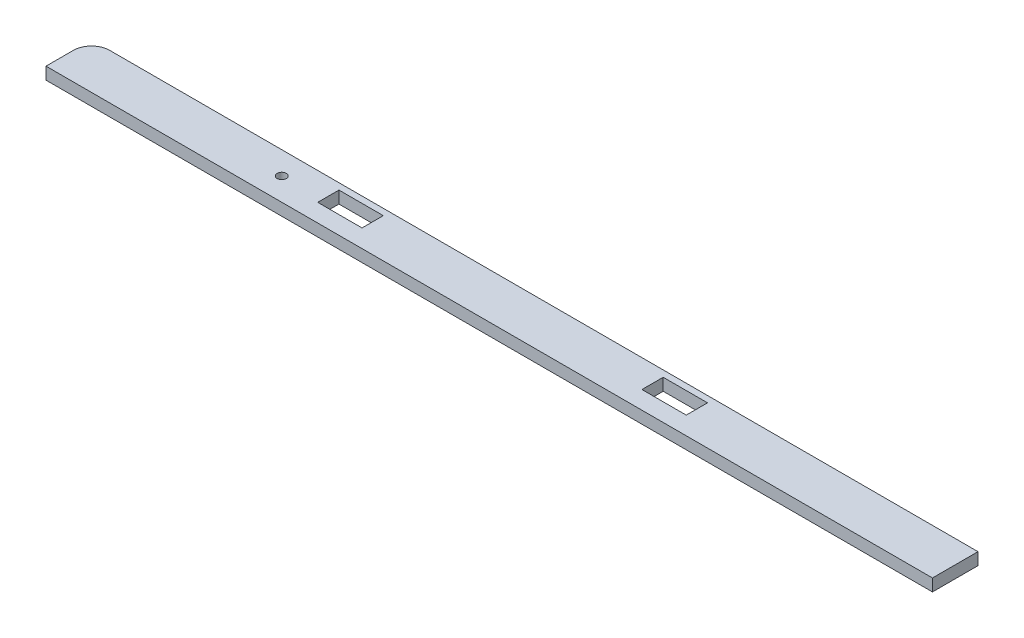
ISO-10303-21;
HEADER;
FILE_DESCRIPTION(('STEP AP214'),'2;1');
FILE_NAME('part.step','',(''),(''),'','','');
FILE_SCHEMA(('AUTOMOTIVE_DESIGN { 1 0 10303 214 1 1 1 1 }'));
ENDSEC;
DATA;
#1=APPLICATION_CONTEXT('core data for automotive mechanical design processes');
#2=APPLICATION_PROTOCOL_DEFINITION('international standard','automotive_design',2000,#1);
#3=PRODUCT_CONTEXT('',#1,'mechanical');
#4=PRODUCT('Part','Part','',(#3));
#5=PRODUCT_RELATED_PRODUCT_CATEGORY('part','',(#4));
#6=PRODUCT_DEFINITION_FORMATION('','',#4);
#7=PRODUCT_DEFINITION_CONTEXT('part definition',#1,'design');
#8=PRODUCT_DEFINITION('design','',#6,#7);
#9=PRODUCT_DEFINITION_SHAPE('','',#8);
#10=(LENGTH_UNIT() NAMED_UNIT(*) SI_UNIT(.MILLI.,.METRE.));
#11=(NAMED_UNIT(*) PLANE_ANGLE_UNIT() SI_UNIT($,.RADIAN.));
#12=(NAMED_UNIT(*) SI_UNIT($,.STERADIAN.) SOLID_ANGLE_UNIT());
#13=UNCERTAINTY_MEASURE_WITH_UNIT(LENGTH_MEASURE(1.E-05),#10,'distance_accuracy_value','');
#14=(GEOMETRIC_REPRESENTATION_CONTEXT(3) GLOBAL_UNCERTAINTY_ASSIGNED_CONTEXT((#13)) GLOBAL_UNIT_ASSIGNED_CONTEXT((#10,
#11,#12)) REPRESENTATION_CONTEXT('',''));
#15=CARTESIAN_POINT('',(0.,0.,0.));
#16=DIRECTION('',(0.,0.,1.));
#17=DIRECTION('',(1.,0.,0.));
#18=AXIS2_PLACEMENT_3D('',#15,#16,#17);
#19=CARTESIAN_POINT('',(-141.,-1.,-121.));
#20=DIRECTION('',(-1.,0.,0.));
#21=DIRECTION('',(0.,0.,1.));
#22=AXIS2_PLACEMENT_3D('',#19,#20,#21);
#23=PLANE('',#22);
#24=DIRECTION('',(0.,0.,1.));
#25=VECTOR('',#24,1.);
#26=CARTESIAN_POINT('',(-141.,3.,-121.));
#27=LINE('',#26,#25);
#28=CARTESIAN_POINT('',(-141.,3.,-115.));
#29=VERTEX_POINT('',#28);
#30=CARTESIAN_POINT('',(-141.,3.,-106.));
#31=VERTEX_POINT('',#30);
#32=EDGE_CURVE('E203',#29,#31,#27,.T.);
#33=ORIENTED_EDGE('',*,*,#32,.F.);
#34=DIRECTION('',(0.,1.,0.));
#35=VECTOR('',#34,1.);
#36=CARTESIAN_POINT('',(-141.,-1.,-115.));
#37=LINE('',#36,#35);
#38=CARTESIAN_POINT('',(-141.,-1.,-115.));
#39=VERTEX_POINT('',#38);
#40=EDGE_CURVE('E43',#29,#39,#37,.F.);
#41=ORIENTED_EDGE('',*,*,#40,.T.);
#42=DIRECTION('',(0.,0.,1.));
#43=VECTOR('',#42,1.);
#44=CARTESIAN_POINT('',(-141.,-1.,-121.));
#45=LINE('',#44,#43);
#46=CARTESIAN_POINT('',(-141.,-1.,-106.));
#47=VERTEX_POINT('',#46);
#48=EDGE_CURVE('E210',#39,#47,#45,.T.);
#49=ORIENTED_EDGE('',*,*,#48,.T.);
#50=DIRECTION('',(0.,1.,0.));
#51=VECTOR('',#50,1.);
#52=CARTESIAN_POINT('',(-141.,-1.,-106.));
#53=LINE('',#52,#51);
#54=EDGE_CURVE('E171',#47,#31,#53,.T.);
#55=ORIENTED_EDGE('',*,*,#54,.T.);
#56=EDGE_LOOP('',(#33,#41,#49,#55));
#57=FACE_BOUND('',#56,.T.);
#58=ADVANCED_FACE('F35',(#57),#23,.T.);
#59=CARTESIAN_POINT('',(151.,-1.,-121.));
#60=DIRECTION('',(0.,0.,-1.));
#61=DIRECTION('',(-1.,0.,0.));
#62=AXIS2_PLACEMENT_3D('',#59,#60,#61);
#63=PLANE('',#62);
#64=DIRECTION('',(-1.,0.,0.));
#65=VECTOR('',#64,1.);
#66=CARTESIAN_POINT('',(151.,-1.,-121.));
#67=LINE('',#66,#65);
#68=CARTESIAN_POINT('',(151.,-1.,-121.));
#69=VERTEX_POINT('',#68);
#70=CARTESIAN_POINT('',(-135.,-1.,-121.));
#71=VERTEX_POINT('',#70);
#72=EDGE_CURVE('E206',#69,#71,#67,.T.);
#73=ORIENTED_EDGE('',*,*,#72,.T.);
#74=DIRECTION('',(0.,1.,0.));
#75=VECTOR('',#74,1.);
#76=CARTESIAN_POINT('',(-135.,-1.,-121.));
#77=LINE('',#76,#75);
#78=CARTESIAN_POINT('',(-135.,3.,-121.));
#79=VERTEX_POINT('',#78);
#80=EDGE_CURVE('E160',#71,#79,#77,.T.);
#81=ORIENTED_EDGE('',*,*,#80,.T.);
#82=DIRECTION('',(-1.,0.,0.));
#83=VECTOR('',#82,1.);
#84=CARTESIAN_POINT('',(151.,3.,-121.));
#85=LINE('',#84,#83);
#86=CARTESIAN_POINT('',(151.,3.,-121.));
#87=VERTEX_POINT('',#86);
#88=EDGE_CURVE('E194',#87,#79,#85,.T.);
#89=ORIENTED_EDGE('',*,*,#88,.F.);
#90=DIRECTION('',(0.,1.,0.));
#91=VECTOR('',#90,1.);
#92=CARTESIAN_POINT('',(151.,-1.,-121.));
#93=LINE('',#92,#91);
#94=EDGE_CURVE('E189',#69,#87,#93,.T.);
#95=ORIENTED_EDGE('',*,*,#94,.F.);
#96=EDGE_LOOP('',(#73,#81,#89,#95));
#97=FACE_BOUND('',#96,.T.);
#98=ADVANCED_FACE('F270',(#97),#63,.T.);
#99=CARTESIAN_POINT('',(151.,-1.,-106.));
#100=DIRECTION('',(1.,0.,0.));
#101=DIRECTION('',(0.,0.,-1.));
#102=AXIS2_PLACEMENT_3D('',#99,#100,#101);
#103=PLANE('',#102);
#104=DIRECTION('',(0.,0.,-1.));
#105=VECTOR('',#104,1.);
#106=CARTESIAN_POINT('',(151.,3.,-106.));
#107=LINE('',#106,#105);
#108=CARTESIAN_POINT('',(151.,3.,-106.));
#109=VERTEX_POINT('',#108);
#110=EDGE_CURVE('E197',#109,#87,#107,.T.);
#111=ORIENTED_EDGE('',*,*,#110,.F.);
#112=DIRECTION('',(0.,1.,0.));
#113=VECTOR('',#112,1.);
#114=CARTESIAN_POINT('',(151.,-1.,-106.));
#115=LINE('',#114,#113);
#116=CARTESIAN_POINT('',(151.,-1.,-106.));
#117=VERTEX_POINT('',#116);
#118=EDGE_CURVE('E183',#117,#109,#115,.T.);
#119=ORIENTED_EDGE('',*,*,#118,.F.);
#120=DIRECTION('',(0.,0.,-1.));
#121=VECTOR('',#120,1.);
#122=CARTESIAN_POINT('',(151.,-1.,-106.));
#123=LINE('',#122,#121);
#124=EDGE_CURVE('E193',#117,#69,#123,.T.);
#125=ORIENTED_EDGE('',*,*,#124,.T.);
#126=ORIENTED_EDGE('',*,*,#94,.T.);
#127=EDGE_LOOP('',(#111,#119,#125,#126));
#128=FACE_BOUND('',#127,.T.);
#129=ADVANCED_FACE('F274',(#128),#103,.T.);
#130=CARTESIAN_POINT('',(-141.,-1.,-106.));
#131=DIRECTION('',(0.,0.,1.));
#132=DIRECTION('',(1.,0.,0.));
#133=AXIS2_PLACEMENT_3D('',#130,#131,#132);
#134=PLANE('',#133);
#135=DIRECTION('',(1.,0.,0.));
#136=VECTOR('',#135,1.);
#137=CARTESIAN_POINT('',(-141.,3.,-106.));
#138=LINE('',#137,#136);
#139=EDGE_CURVE('E200',#31,#109,#138,.T.);
#140=ORIENTED_EDGE('',*,*,#139,.F.);
#141=ORIENTED_EDGE('',*,*,#54,.F.);
#142=DIRECTION('',(1.,0.,0.));
#143=VECTOR('',#142,1.);
#144=CARTESIAN_POINT('',(-141.,-1.,-106.));
#145=LINE('',#144,#143);
#146=EDGE_CURVE('E184',#47,#117,#145,.T.);
#147=ORIENTED_EDGE('',*,*,#146,.T.);
#148=ORIENTED_EDGE('',*,*,#118,.T.);
#149=EDGE_LOOP('',(#140,#141,#147,#148));
#150=FACE_BOUND('',#149,.T.);
#151=ADVANCED_FACE('F292',(#150),#134,.T.);
#152=CARTESIAN_POINT('',(0.,-1.,0.));
#153=DIRECTION('',(0.,1.,0.));
#154=DIRECTION('',(0.,0.,1.));
#155=AXIS2_PLACEMENT_3D('',#152,#153,#154);
#156=PLANE('',#155);
#157=DIRECTION('',(-1.,0.,0.));
#158=VECTOR('',#157,1.);
#159=CARTESIAN_POINT('',(-57.4000000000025,-1.,-118.900000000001));
#160=LINE('',#159,#158);
#161=CARTESIAN_POINT('',(-42.8000000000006,-1.,-118.900000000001));
#162=VERTEX_POINT('',#161);
#163=CARTESIAN_POINT('',(-57.4000000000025,-1.,-118.900000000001));
#164=VERTEX_POINT('',#163);
#165=EDGE_CURVE('E156',#162,#164,#160,.T.);
#166=ORIENTED_EDGE('',*,*,#165,.T.);
#167=DIRECTION('',(0.,0.,1.));
#168=VECTOR('',#167,1.);
#169=CARTESIAN_POINT('',(-57.4000000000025,-1.,-118.900000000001));
#170=LINE('',#169,#168);
#171=CARTESIAN_POINT('',(-57.4000000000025,-1.,-111.900000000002));
#172=VERTEX_POINT('',#171);
#173=EDGE_CURVE('E154',#164,#172,#170,.T.);
#174=ORIENTED_EDGE('',*,*,#173,.T.);
#175=DIRECTION('',(1.,0.,0.));
#176=VECTOR('',#175,1.);
#177=CARTESIAN_POINT('',(-57.4000000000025,-1.,-111.900000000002));
#178=LINE('',#177,#176);
#179=CARTESIAN_POINT('',(-42.8000000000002,-1.,-111.9));
#180=VERTEX_POINT('',#179);
#181=EDGE_CURVE('E139',#172,#180,#178,.T.);
#182=ORIENTED_EDGE('',*,*,#181,.T.);
#183=DIRECTION('',(0.,0.,-1.));
#184=VECTOR('',#183,1.);
#185=CARTESIAN_POINT('',(-42.8000000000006,-1.,-118.900000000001));
#186=LINE('',#185,#184);
#187=EDGE_CURVE('E127',#180,#162,#186,.T.);
#188=ORIENTED_EDGE('',*,*,#187,.T.);
#189=EDGE_LOOP('',(#166,#174,#182,#188));
#190=FACE_BOUND('',#189,.T.);
#191=DIRECTION('',(-1.,0.,0.));
#192=VECTOR('',#191,1.);
#193=CARTESIAN_POINT('',(49.3999999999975,-1.,-118.900000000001));
#194=LINE('',#193,#192);
#195=CARTESIAN_POINT('',(63.9999999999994,-1.,-118.900000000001));
#196=VERTEX_POINT('',#195);
#197=CARTESIAN_POINT('',(49.3999999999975,-1.,-118.900000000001));
#198=VERTEX_POINT('',#197);
#199=EDGE_CURVE('E138',#196,#198,#194,.T.);
#200=ORIENTED_EDGE('',*,*,#199,.T.);
#201=DIRECTION('',(0.,0.,1.));
#202=VECTOR('',#201,1.);
#203=CARTESIAN_POINT('',(49.3999999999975,-1.,-118.900000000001));
#204=LINE('',#203,#202);
#205=CARTESIAN_POINT('',(49.3999999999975,-1.,-111.900000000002));
#206=VERTEX_POINT('',#205);
#207=EDGE_CURVE('E238',#198,#206,#204,.T.);
#208=ORIENTED_EDGE('',*,*,#207,.T.);
#209=DIRECTION('',(1.,0.,0.));
#210=VECTOR('',#209,1.);
#211=CARTESIAN_POINT('',(49.3999999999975,-1.,-111.900000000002));
#212=LINE('',#211,#210);
#213=CARTESIAN_POINT('',(63.9999999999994,-1.,-111.900000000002));
#214=VERTEX_POINT('',#213);
#215=EDGE_CURVE('E241',#206,#214,#212,.T.);
#216=ORIENTED_EDGE('',*,*,#215,.T.);
#217=DIRECTION('',(0.,0.,-1.));
#218=VECTOR('',#217,1.);
#219=CARTESIAN_POINT('',(63.9999999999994,-1.,-118.900000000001));
#220=LINE('',#219,#218);
#221=EDGE_CURVE('E217',#214,#196,#220,.T.);
#222=ORIENTED_EDGE('',*,*,#221,.T.);
#223=EDGE_LOOP('',(#200,#208,#216,#222));
#224=FACE_BOUND('',#223,.T.);
#225=CARTESIAN_POINT('',(-70.85,-1.,-113.5));
#226=DIRECTION('',(0.,1.,0.));
#227=DIRECTION('',(0.,0.,1.));
#228=AXIS2_PLACEMENT_3D('',#225,#226,#227);
#229=CIRCLE('',#228,1.5);
#230=CARTESIAN_POINT('',(-70.85,-1.,-112.));
#231=VERTEX_POINT('',#230);
#232=EDGE_CURVE('E205',#231,#231,#229,.T.);
#233=ORIENTED_EDGE('',*,*,#232,.T.);
#234=EDGE_LOOP('',(#233));
#235=FACE_BOUND('',#234,.T.);
#236=ORIENTED_EDGE('',*,*,#48,.F.);
#237=CARTESIAN_POINT('',(-135.,-1.,-115.));
#238=DIRECTION('',(0.,1.,0.));
#239=DIRECTION('',(0.,0.,1.));
#240=AXIS2_PLACEMENT_3D('',#237,#238,#239);
#241=CIRCLE('',#240,6.);
#242=EDGE_CURVE('E11',#39,#71,#241,.F.);
#243=ORIENTED_EDGE('',*,*,#242,.T.);
#244=ORIENTED_EDGE('',*,*,#72,.F.);
#245=ORIENTED_EDGE('',*,*,#124,.F.);
#246=ORIENTED_EDGE('',*,*,#146,.F.);
#247=EDGE_LOOP('',(#236,#243,#244,#245,#246));
#248=FACE_BOUND('',#247,.T.);
#249=ADVANCED_FACE('F151',(#190,#224,#235,#248),#156,.F.);
#250=CARTESIAN_POINT('',(0.,3.,0.));
#251=DIRECTION('',(0.,1.,0.));
#252=DIRECTION('',(0.,0.,1.));
#253=AXIS2_PLACEMENT_3D('',#250,#251,#252);
#254=PLANE('',#253);
#255=DIRECTION('',(0.,0.,1.));
#256=VECTOR('',#255,1.);
#257=CARTESIAN_POINT('',(-57.4000000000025,3.,-118.900000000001));
#258=LINE('',#257,#256);
#259=CARTESIAN_POINT('',(-57.4000000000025,3.,-118.900000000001));
#260=VERTEX_POINT('',#259);
#261=CARTESIAN_POINT('',(-57.4000000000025,3.,-111.900000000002));
#262=VERTEX_POINT('',#261);
#263=EDGE_CURVE('E178',#260,#262,#258,.T.);
#264=ORIENTED_EDGE('',*,*,#263,.F.);
#265=DIRECTION('',(-1.,0.,0.));
#266=VECTOR('',#265,1.);
#267=CARTESIAN_POINT('',(-57.4000000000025,3.,-118.900000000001));
#268=LINE('',#267,#266);
#269=CARTESIAN_POINT('',(-42.8000000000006,3.,-118.900000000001));
#270=VERTEX_POINT('',#269);
#271=EDGE_CURVE('E175',#270,#260,#268,.T.);
#272=ORIENTED_EDGE('',*,*,#271,.F.);
#273=DIRECTION('',(0.,0.,-1.));
#274=VECTOR('',#273,1.);
#275=CARTESIAN_POINT('',(-42.8000000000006,3.,-118.900000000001));
#276=LINE('',#275,#274);
#277=CARTESIAN_POINT('',(-42.8000000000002,3.,-111.9));
#278=VERTEX_POINT('',#277);
#279=EDGE_CURVE('E149',#278,#270,#276,.T.);
#280=ORIENTED_EDGE('',*,*,#279,.F.);
#281=DIRECTION('',(1.,0.,0.));
#282=VECTOR('',#281,1.);
#283=CARTESIAN_POINT('',(-57.4000000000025,3.,-111.900000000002));
#284=LINE('',#283,#282);
#285=EDGE_CURVE('E147',#262,#278,#284,.T.);
#286=ORIENTED_EDGE('',*,*,#285,.F.);
#287=EDGE_LOOP('',(#264,#272,#280,#286));
#288=FACE_BOUND('',#287,.T.);
#289=DIRECTION('',(0.,0.,1.));
#290=VECTOR('',#289,1.);
#291=CARTESIAN_POINT('',(49.3999999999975,3.,-118.900000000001));
#292=LINE('',#291,#290);
#293=CARTESIAN_POINT('',(49.3999999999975,3.,-118.900000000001));
#294=VERTEX_POINT('',#293);
#295=CARTESIAN_POINT('',(49.3999999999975,3.,-111.900000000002));
#296=VERTEX_POINT('',#295);
#297=EDGE_CURVE('E214',#294,#296,#292,.T.);
#298=ORIENTED_EDGE('',*,*,#297,.F.);
#299=DIRECTION('',(-1.,0.,0.));
#300=VECTOR('',#299,1.);
#301=CARTESIAN_POINT('',(49.3999999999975,3.,-118.900000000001));
#302=LINE('',#301,#300);
#303=CARTESIAN_POINT('',(63.9999999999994,3.,-118.900000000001));
#304=VERTEX_POINT('',#303);
#305=EDGE_CURVE('E226',#304,#294,#302,.T.);
#306=ORIENTED_EDGE('',*,*,#305,.F.);
#307=DIRECTION('',(0.,0.,-1.));
#308=VECTOR('',#307,1.);
#309=CARTESIAN_POINT('',(63.9999999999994,3.,-118.900000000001));
#310=LINE('',#309,#308);
#311=CARTESIAN_POINT('',(63.9999999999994,3.,-111.900000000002));
#312=VERTEX_POINT('',#311);
#313=EDGE_CURVE('E223',#312,#304,#310,.T.);
#314=ORIENTED_EDGE('',*,*,#313,.F.);
#315=DIRECTION('',(1.,0.,0.));
#316=VECTOR('',#315,1.);
#317=CARTESIAN_POINT('',(49.3999999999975,3.,-111.900000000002));
#318=LINE('',#317,#316);
#319=EDGE_CURVE('E220',#296,#312,#318,.T.);
#320=ORIENTED_EDGE('',*,*,#319,.F.);
#321=EDGE_LOOP('',(#298,#306,#314,#320));
#322=FACE_BOUND('',#321,.T.);
#323=CARTESIAN_POINT('',(-70.85,3.,-113.5));
#324=DIRECTION('',(0.,1.,0.));
#325=DIRECTION('',(0.,0.,1.));
#326=AXIS2_PLACEMENT_3D('',#323,#324,#325);
#327=CIRCLE('',#326,1.5);
#328=CARTESIAN_POINT('',(-70.85,3.,-112.));
#329=VERTEX_POINT('',#328);
#330=EDGE_CURVE('E196',#329,#329,#327,.T.);
#331=ORIENTED_EDGE('',*,*,#330,.F.);
#332=EDGE_LOOP('',(#331));
#333=FACE_BOUND('',#332,.T.);
#334=ORIENTED_EDGE('',*,*,#88,.T.);
#335=CARTESIAN_POINT('',(-135.,3.,-115.));
#336=DIRECTION('',(0.,1.,0.));
#337=DIRECTION('',(0.,0.,1.));
#338=AXIS2_PLACEMENT_3D('',#335,#336,#337);
#339=CIRCLE('',#338,6.);
#340=EDGE_CURVE('E57',#79,#29,#339,.T.);
#341=ORIENTED_EDGE('',*,*,#340,.T.);
#342=ORIENTED_EDGE('',*,*,#32,.T.);
#343=ORIENTED_EDGE('',*,*,#139,.T.);
#344=ORIENTED_EDGE('',*,*,#110,.T.);
#345=EDGE_LOOP('',(#334,#341,#342,#343,#344));
#346=FACE_BOUND('',#345,.T.);
#347=ADVANCED_FACE('F263',(#288,#322,#333,#346),#254,.T.);
#348=CARTESIAN_POINT('',(-70.85,-1.,-113.5));
#349=DIRECTION('',(0.,1.,0.));
#350=DIRECTION('',(0.,0.,1.));
#351=AXIS2_PLACEMENT_3D('',#348,#349,#350);
#352=CYLINDRICAL_SURFACE('',#351,1.5);
#353=ORIENTED_EDGE('',*,*,#232,.F.);
#354=EDGE_LOOP('',(#353));
#355=FACE_BOUND('',#354,.T.);
#356=ORIENTED_EDGE('',*,*,#330,.T.);
#357=EDGE_LOOP('',(#356));
#358=FACE_BOUND('',#357,.T.);
#359=ADVANCED_FACE('F266',(#355,#358),#352,.F.);
#360=CARTESIAN_POINT('',(49.3999999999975,-1.,-118.900000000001));
#361=DIRECTION('',(-1.,0.,0.));
#362=DIRECTION('',(0.,0.,1.));
#363=AXIS2_PLACEMENT_3D('',#360,#361,#362);
#364=PLANE('',#363);
#365=ORIENTED_EDGE('',*,*,#297,.T.);
#366=DIRECTION('',(0.,1.,0.));
#367=VECTOR('',#366,1.);
#368=CARTESIAN_POINT('',(49.3999999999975,-1.,-111.900000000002));
#369=LINE('',#368,#367);
#370=EDGE_CURVE('E182',#206,#296,#369,.T.);
#371=ORIENTED_EDGE('',*,*,#370,.F.);
#372=ORIENTED_EDGE('',*,*,#207,.F.);
#373=DIRECTION('',(0.,1.,0.));
#374=VECTOR('',#373,1.);
#375=CARTESIAN_POINT('',(49.3999999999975,-1.,-118.900000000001));
#376=LINE('',#375,#374);
#377=EDGE_CURVE('E227',#198,#294,#376,.T.);
#378=ORIENTED_EDGE('',*,*,#377,.T.);
#379=EDGE_LOOP('',(#365,#371,#372,#378));
#380=FACE_BOUND('',#379,.T.);
#381=ADVANCED_FACE('F250',(#380),#364,.F.);
#382=CARTESIAN_POINT('',(49.3999999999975,-1.,-118.900000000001));
#383=DIRECTION('',(0.,0.,-1.));
#384=DIRECTION('',(-1.,0.,0.));
#385=AXIS2_PLACEMENT_3D('',#382,#383,#384);
#386=PLANE('',#385);
#387=ORIENTED_EDGE('',*,*,#305,.T.);
#388=ORIENTED_EDGE('',*,*,#377,.F.);
#389=ORIENTED_EDGE('',*,*,#199,.F.);
#390=DIRECTION('',(0.,1.,0.));
#391=VECTOR('',#390,1.);
#392=CARTESIAN_POINT('',(63.9999999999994,-1.,-118.900000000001));
#393=LINE('',#392,#391);
#394=EDGE_CURVE('E224',#196,#304,#393,.T.);
#395=ORIENTED_EDGE('',*,*,#394,.T.);
#396=EDGE_LOOP('',(#387,#388,#389,#395));
#397=FACE_BOUND('',#396,.T.);
#398=ADVANCED_FACE('F261',(#397),#386,.F.);
#399=CARTESIAN_POINT('',(63.9999999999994,-1.,-118.900000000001));
#400=DIRECTION('',(1.,0.,0.));
#401=DIRECTION('',(0.,0.,-1.));
#402=AXIS2_PLACEMENT_3D('',#399,#400,#401);
#403=PLANE('',#402);
#404=ORIENTED_EDGE('',*,*,#313,.T.);
#405=ORIENTED_EDGE('',*,*,#394,.F.);
#406=ORIENTED_EDGE('',*,*,#221,.F.);
#407=DIRECTION('',(0.,1.,0.));
#408=VECTOR('',#407,1.);
#409=CARTESIAN_POINT('',(63.9999999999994,-1.,-111.900000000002));
#410=LINE('',#409,#408);
#411=EDGE_CURVE('E221',#214,#312,#410,.T.);
#412=ORIENTED_EDGE('',*,*,#411,.T.);
#413=EDGE_LOOP('',(#404,#405,#406,#412));
#414=FACE_BOUND('',#413,.T.);
#415=ADVANCED_FACE('F258',(#414),#403,.F.);
#416=CARTESIAN_POINT('',(49.3999999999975,-1.,-111.900000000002));
#417=DIRECTION('',(0.,0.,1.));
#418=DIRECTION('',(1.,0.,0.));
#419=AXIS2_PLACEMENT_3D('',#416,#417,#418);
#420=PLANE('',#419);
#421=ORIENTED_EDGE('',*,*,#319,.T.);
#422=ORIENTED_EDGE('',*,*,#411,.F.);
#423=ORIENTED_EDGE('',*,*,#215,.F.);
#424=ORIENTED_EDGE('',*,*,#370,.T.);
#425=EDGE_LOOP('',(#421,#422,#423,#424));
#426=FACE_BOUND('',#425,.T.);
#427=ADVANCED_FACE('F255',(#426),#420,.F.);
#428=CARTESIAN_POINT('',(-57.4000000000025,-1.,-118.900000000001));
#429=DIRECTION('',(-1.,0.,0.));
#430=DIRECTION('',(0.,0.,1.));
#431=AXIS2_PLACEMENT_3D('',#428,#429,#430);
#432=PLANE('',#431);
#433=ORIENTED_EDGE('',*,*,#263,.T.);
#434=DIRECTION('',(0.,1.,0.));
#435=VECTOR('',#434,1.);
#436=CARTESIAN_POINT('',(-57.4000000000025,-1.,-111.900000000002));
#437=LINE('',#436,#435);
#438=EDGE_CURVE('E163',#172,#262,#437,.T.);
#439=ORIENTED_EDGE('',*,*,#438,.F.);
#440=ORIENTED_EDGE('',*,*,#173,.F.);
#441=DIRECTION('',(0.,1.,0.));
#442=VECTOR('',#441,1.);
#443=CARTESIAN_POINT('',(-57.4000000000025,-1.,-118.900000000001));
#444=LINE('',#443,#442);
#445=EDGE_CURVE('E176',#164,#260,#444,.T.);
#446=ORIENTED_EDGE('',*,*,#445,.T.);
#447=EDGE_LOOP('',(#433,#439,#440,#446));
#448=FACE_BOUND('',#447,.T.);
#449=ADVANCED_FACE('F294',(#448),#432,.F.);
#450=CARTESIAN_POINT('',(-57.4000000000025,-1.,-118.900000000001));
#451=DIRECTION('',(0.,0.,-1.));
#452=DIRECTION('',(-1.,0.,0.));
#453=AXIS2_PLACEMENT_3D('',#450,#451,#452);
#454=PLANE('',#453);
#455=ORIENTED_EDGE('',*,*,#271,.T.);
#456=ORIENTED_EDGE('',*,*,#445,.F.);
#457=ORIENTED_EDGE('',*,*,#165,.F.);
#458=DIRECTION('',(0.,1.,0.));
#459=VECTOR('',#458,1.);
#460=CARTESIAN_POINT('',(-42.8000000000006,-1.,-118.900000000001));
#461=LINE('',#460,#459);
#462=EDGE_CURVE('E133',#162,#270,#461,.T.);
#463=ORIENTED_EDGE('',*,*,#462,.T.);
#464=EDGE_LOOP('',(#455,#456,#457,#463));
#465=FACE_BOUND('',#464,.T.);
#466=ADVANCED_FACE('F296',(#465),#454,.F.);
#467=CARTESIAN_POINT('',(-42.8000000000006,-1.,-118.900000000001));
#468=DIRECTION('',(1.,0.,0.));
#469=DIRECTION('',(0.,0.,-1.));
#470=AXIS2_PLACEMENT_3D('',#467,#468,#469);
#471=PLANE('',#470);
#472=ORIENTED_EDGE('',*,*,#279,.T.);
#473=ORIENTED_EDGE('',*,*,#462,.F.);
#474=ORIENTED_EDGE('',*,*,#187,.F.);
#475=DIRECTION('',(0.,1.,0.));
#476=VECTOR('',#475,1.);
#477=CARTESIAN_POINT('',(-42.8000000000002,-1.,-111.9));
#478=LINE('',#477,#476);
#479=EDGE_CURVE('E131',#180,#278,#478,.T.);
#480=ORIENTED_EDGE('',*,*,#479,.T.);
#481=EDGE_LOOP('',(#472,#473,#474,#480));
#482=FACE_BOUND('',#481,.T.);
#483=ADVANCED_FACE('F130',(#482),#471,.F.);
#484=CARTESIAN_POINT('',(-57.4000000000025,-1.,-111.900000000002));
#485=DIRECTION('',(0.,0.,1.));
#486=DIRECTION('',(1.,0.,0.));
#487=AXIS2_PLACEMENT_3D('',#484,#485,#486);
#488=PLANE('',#487);
#489=ORIENTED_EDGE('',*,*,#285,.T.);
#490=ORIENTED_EDGE('',*,*,#479,.F.);
#491=ORIENTED_EDGE('',*,*,#181,.F.);
#492=ORIENTED_EDGE('',*,*,#438,.T.);
#493=EDGE_LOOP('',(#489,#490,#491,#492));
#494=FACE_BOUND('',#493,.T.);
#495=ADVANCED_FACE('F143',(#494),#488,.F.);
#496=CARTESIAN_POINT('',(-135.,-1.,-115.));
#497=DIRECTION('',(0.,1.,0.));
#498=DIRECTION('',(0.,0.,1.));
#499=AXIS2_PLACEMENT_3D('',#496,#497,#498);
#500=CYLINDRICAL_SURFACE('',#499,6.);
#501=ORIENTED_EDGE('',*,*,#242,.F.);
#502=ORIENTED_EDGE('',*,*,#40,.F.);
#503=ORIENTED_EDGE('',*,*,#340,.F.);
#504=ORIENTED_EDGE('',*,*,#80,.F.);
#505=EDGE_LOOP('',(#501,#502,#503,#504));
#506=FACE_BOUND('',#505,.T.);
#507=ADVANCED_FACE('F37',(#506),#500,.T.);
#508=CLOSED_SHELL('',(#58,#98,#129,#151,#249,#347,#359,#381,#398,#415,#427,#449,#466,#483,#495,#507));
#509=MANIFOLD_SOLID_BREP('B2',#508);
#510=ADVANCED_BREP_SHAPE_REPRESENTATION('',(#18,#509),#14);
#511=SHAPE_DEFINITION_REPRESENTATION(#9,#510);
ENDSEC;
END-ISO-10303-21;
